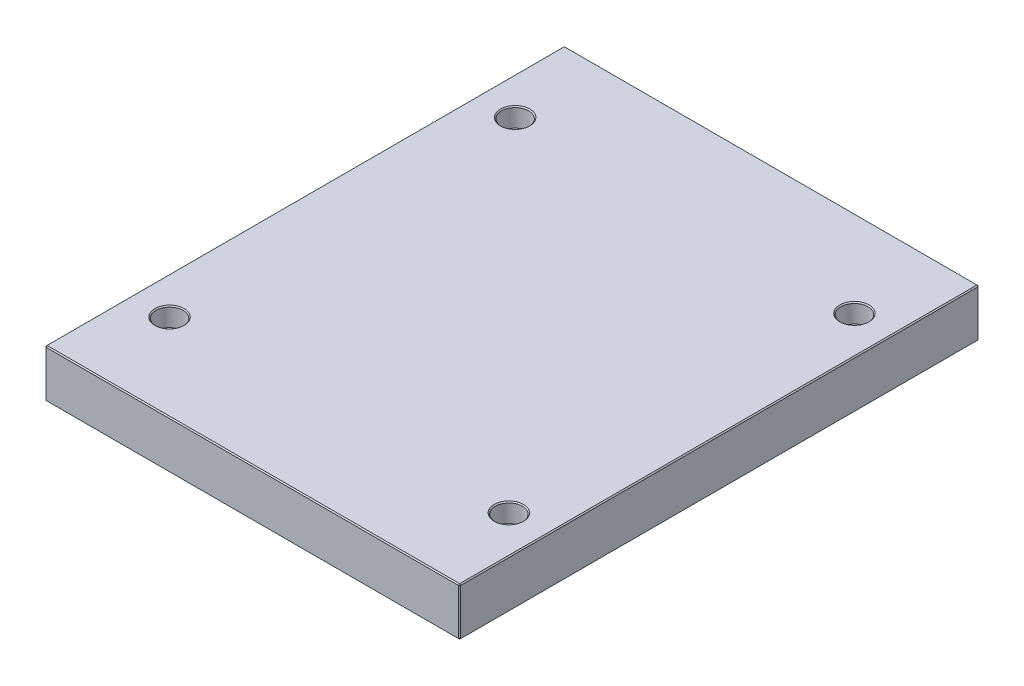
ISO-10303-21;
HEADER;
FILE_DESCRIPTION(('STEP AP214'),'2;1');
FILE_NAME('part.step','',(''),(''),'','','');
FILE_SCHEMA(('AUTOMOTIVE_DESIGN { 1 0 10303 214 1 1 1 1 }'));
ENDSEC;
DATA;
#1=APPLICATION_CONTEXT('core data for automotive mechanical design processes');
#2=APPLICATION_PROTOCOL_DEFINITION('international standard','automotive_design',2000,#1);
#3=PRODUCT_CONTEXT('',#1,'mechanical');
#4=PRODUCT('Part','Part','',(#3));
#5=PRODUCT_RELATED_PRODUCT_CATEGORY('part','',(#4));
#6=PRODUCT_DEFINITION_FORMATION('','',#4);
#7=PRODUCT_DEFINITION_CONTEXT('part definition',#1,'design');
#8=PRODUCT_DEFINITION('design','',#6,#7);
#9=PRODUCT_DEFINITION_SHAPE('','',#8);
#10=(LENGTH_UNIT() NAMED_UNIT(*) SI_UNIT(.MILLI.,.METRE.));
#11=(NAMED_UNIT(*) PLANE_ANGLE_UNIT() SI_UNIT($,.RADIAN.));
#12=(NAMED_UNIT(*) SI_UNIT($,.STERADIAN.) SOLID_ANGLE_UNIT());
#13=UNCERTAINTY_MEASURE_WITH_UNIT(LENGTH_MEASURE(1.E-05),#10,'distance_accuracy_value','');
#14=(GEOMETRIC_REPRESENTATION_CONTEXT(3) GLOBAL_UNCERTAINTY_ASSIGNED_CONTEXT((#13)) GLOBAL_UNIT_ASSIGNED_CONTEXT((#10,
#11,#12)) REPRESENTATION_CONTEXT('',''));
#15=CARTESIAN_POINT('',(0.,0.,0.));
#16=DIRECTION('',(0.,0.,1.));
#17=DIRECTION('',(1.,0.,0.));
#18=AXIS2_PLACEMENT_3D('',#15,#16,#17);
#19=CARTESIAN_POINT('',(-198.,46.,248.));
#20=DIRECTION('',(1.,0.,0.));
#21=DIRECTION('',(0.,0.,-1.));
#22=AXIS2_PLACEMENT_3D('',#19,#20,#21);
#23=PLANE('',#22);
#24=DIRECTION('',(0.,-1.,0.));
#25=VECTOR('',#24,1.);
#26=CARTESIAN_POINT('',(-198.,46.,-247.));
#27=LINE('',#26,#25);
#28=CARTESIAN_POINT('',(-198.,45.,-247.));
#29=VERTEX_POINT('',#28);
#30=CARTESIAN_POINT('',(-198.,1.,-247.));
#31=VERTEX_POINT('',#30);
#32=EDGE_CURVE('E115',#29,#31,#27,.T.);
#33=ORIENTED_EDGE('',*,*,#32,.T.);
#34=DIRECTION('',(0.,0.,1.));
#35=VECTOR('',#34,1.);
#36=CARTESIAN_POINT('',(-198.,1.,248.));
#37=LINE('',#36,#35);
#38=CARTESIAN_POINT('',(-198.,1.,247.));
#39=VERTEX_POINT('',#38);
#40=EDGE_CURVE('E111',#31,#39,#37,.T.);
#41=ORIENTED_EDGE('',*,*,#40,.T.);
#42=DIRECTION('',(0.,1.,0.));
#43=VECTOR('',#42,1.);
#44=CARTESIAN_POINT('',(-198.,46.,247.));
#45=LINE('',#44,#43);
#46=CARTESIAN_POINT('',(-198.,45.,247.));
#47=VERTEX_POINT('',#46);
#48=EDGE_CURVE('E104',#39,#47,#45,.T.);
#49=ORIENTED_EDGE('',*,*,#48,.T.);
#50=DIRECTION('',(0.,0.,-1.));
#51=VECTOR('',#50,1.);
#52=CARTESIAN_POINT('',(-198.,45.,-248.));
#53=LINE('',#52,#51);
#54=EDGE_CURVE('E108',#47,#29,#53,.T.);
#55=ORIENTED_EDGE('',*,*,#54,.T.);
#56=EDGE_LOOP('',(#33,#41,#49,#55));
#57=FACE_BOUND('',#56,.T.);
#58=ADVANCED_FACE('F16',(#57),#23,.F.);
#59=CARTESIAN_POINT('',(198.,46.,248.));
#60=DIRECTION('',(0.,0.,-1.));
#61=DIRECTION('',(-1.,0.,0.));
#62=AXIS2_PLACEMENT_3D('',#59,#60,#61);
#63=PLANE('',#62);
#64=DIRECTION('',(-1.,0.,0.));
#65=VECTOR('',#64,1.);
#66=CARTESIAN_POINT('',(-198.,45.,248.));
#67=LINE('',#66,#65);
#68=CARTESIAN_POINT('',(197.,45.,248.));
#69=VERTEX_POINT('',#68);
#70=CARTESIAN_POINT('',(-197.,45.,248.));
#71=VERTEX_POINT('',#70);
#72=EDGE_CURVE('E170',#69,#71,#67,.T.);
#73=ORIENTED_EDGE('',*,*,#72,.T.);
#74=DIRECTION('',(0.,-1.,0.));
#75=VECTOR('',#74,1.);
#76=CARTESIAN_POINT('',(-197.,46.,248.));
#77=LINE('',#76,#75);
#78=CARTESIAN_POINT('',(-197.,1.,248.));
#79=VERTEX_POINT('',#78);
#80=EDGE_CURVE('E123',#71,#79,#77,.T.);
#81=ORIENTED_EDGE('',*,*,#80,.T.);
#82=DIRECTION('',(1.,0.,0.));
#83=VECTOR('',#82,1.);
#84=CARTESIAN_POINT('',(198.,1.,248.));
#85=LINE('',#84,#83);
#86=CARTESIAN_POINT('',(197.,1.,248.));
#87=VERTEX_POINT('',#86);
#88=EDGE_CURVE('E174',#79,#87,#85,.T.);
#89=ORIENTED_EDGE('',*,*,#88,.T.);
#90=DIRECTION('',(0.,1.,0.));
#91=VECTOR('',#90,1.);
#92=CARTESIAN_POINT('',(197.,46.,248.));
#93=LINE('',#92,#91);
#94=EDGE_CURVE('E172',#87,#69,#93,.T.);
#95=ORIENTED_EDGE('',*,*,#94,.T.);
#96=EDGE_LOOP('',(#73,#81,#89,#95));
#97=FACE_BOUND('',#96,.T.);
#98=ADVANCED_FACE('F317',(#97),#63,.F.);
#99=CARTESIAN_POINT('',(198.,46.,248.));
#100=DIRECTION('',(-1.,0.,0.));
#101=DIRECTION('',(0.,0.,1.));
#102=AXIS2_PLACEMENT_3D('',#99,#100,#101);
#103=PLANE('',#102);
#104=DIRECTION('',(0.,0.,-1.));
#105=VECTOR('',#104,1.);
#106=CARTESIAN_POINT('',(198.,1.,248.));
#107=LINE('',#106,#105);
#108=CARTESIAN_POINT('',(198.,1.,247.));
#109=VERTEX_POINT('',#108);
#110=CARTESIAN_POINT('',(198.,1.,-247.));
#111=VERTEX_POINT('',#110);
#112=EDGE_CURVE('E165',#109,#111,#107,.T.);
#113=ORIENTED_EDGE('',*,*,#112,.T.);
#114=DIRECTION('',(0.,1.,0.));
#115=VECTOR('',#114,1.);
#116=CARTESIAN_POINT('',(198.,46.,-247.));
#117=LINE('',#116,#115);
#118=CARTESIAN_POINT('',(198.,45.,-247.));
#119=VERTEX_POINT('',#118);
#120=EDGE_CURVE('E167',#111,#119,#117,.T.);
#121=ORIENTED_EDGE('',*,*,#120,.T.);
#122=DIRECTION('',(0.,0.,1.));
#123=VECTOR('',#122,1.);
#124=CARTESIAN_POINT('',(198.,45.,248.));
#125=LINE('',#124,#123);
#126=CARTESIAN_POINT('',(198.,45.,247.));
#127=VERTEX_POINT('',#126);
#128=EDGE_CURVE('E161',#119,#127,#125,.T.);
#129=ORIENTED_EDGE('',*,*,#128,.T.);
#130=DIRECTION('',(0.,-1.,0.));
#131=VECTOR('',#130,1.);
#132=CARTESIAN_POINT('',(198.,46.,247.));
#133=LINE('',#132,#131);
#134=EDGE_CURVE('E163',#127,#109,#133,.T.);
#135=ORIENTED_EDGE('',*,*,#134,.T.);
#136=EDGE_LOOP('',(#113,#121,#129,#135));
#137=FACE_BOUND('',#136,.T.);
#138=ADVANCED_FACE('F323',(#137),#103,.F.);
#139=CARTESIAN_POINT('',(198.,46.,-248.));
#140=DIRECTION('',(0.,0.,1.));
#141=DIRECTION('',(1.,0.,0.));
#142=AXIS2_PLACEMENT_3D('',#139,#140,#141);
#143=PLANE('',#142);
#144=DIRECTION('',(0.,-1.,0.));
#145=VECTOR('',#144,1.);
#146=CARTESIAN_POINT('',(197.,46.,-248.));
#147=LINE('',#146,#145);
#148=CARTESIAN_POINT('',(197.,45.,-248.));
#149=VERTEX_POINT('',#148);
#150=CARTESIAN_POINT('',(197.,1.,-248.));
#151=VERTEX_POINT('',#150);
#152=EDGE_CURVE('E154',#149,#151,#147,.T.);
#153=ORIENTED_EDGE('',*,*,#152,.T.);
#154=DIRECTION('',(-1.,0.,0.));
#155=VECTOR('',#154,1.);
#156=CARTESIAN_POINT('',(198.,1.,-248.));
#157=LINE('',#156,#155);
#158=CARTESIAN_POINT('',(-197.,1.,-248.));
#159=VERTEX_POINT('',#158);
#160=EDGE_CURVE('E159',#151,#159,#157,.T.);
#161=ORIENTED_EDGE('',*,*,#160,.T.);
#162=DIRECTION('',(0.,1.,0.));
#163=VECTOR('',#162,1.);
#164=CARTESIAN_POINT('',(-197.,46.,-248.));
#165=LINE('',#164,#163);
#166=CARTESIAN_POINT('',(-197.,45.,-248.));
#167=VERTEX_POINT('',#166);
#168=EDGE_CURVE('E156',#159,#167,#165,.T.);
#169=ORIENTED_EDGE('',*,*,#168,.T.);
#170=DIRECTION('',(1.,0.,0.));
#171=VECTOR('',#170,1.);
#172=CARTESIAN_POINT('',(198.,45.,-248.));
#173=LINE('',#172,#171);
#174=EDGE_CURVE('E152',#167,#149,#173,.T.);
#175=ORIENTED_EDGE('',*,*,#174,.T.);
#176=EDGE_LOOP('',(#153,#161,#169,#175));
#177=FACE_BOUND('',#176,.T.);
#178=ADVANCED_FACE('F465',(#177),#143,.F.);
#179=CARTESIAN_POINT('',(0.,46.,0.));
#180=DIRECTION('',(0.,1.,0.));
#181=DIRECTION('',(0.,0.,1.));
#182=AXIS2_PLACEMENT_3D('',#179,#180,#181);
#183=PLANE('',#182);
#184=CARTESIAN_POINT('',(-162.,46.,165.));
#185=DIRECTION('',(0.,1.,0.));
#186=DIRECTION('',(0.,0.,1.));
#187=AXIS2_PLACEMENT_3D('',#184,#185,#186);
#188=CIRCLE('',#187,14.0000000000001);
#189=CARTESIAN_POINT('',(-162.,46.,179.));
#190=VERTEX_POINT('',#189);
#191=EDGE_CURVE('E290',#190,#190,#188,.F.);
#192=ORIENTED_EDGE('',*,*,#191,.T.);
#193=EDGE_LOOP('',(#192));
#194=FACE_BOUND('',#193,.T.);
#195=CARTESIAN_POINT('',(162.,46.,165.));
#196=DIRECTION('',(0.,1.,0.));
#197=DIRECTION('',(0.,0.,1.));
#198=AXIS2_PLACEMENT_3D('',#195,#196,#197);
#199=CIRCLE('',#198,14.0000000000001);
#200=CARTESIAN_POINT('',(162.,46.,179.));
#201=VERTEX_POINT('',#200);
#202=EDGE_CURVE('E287',#201,#201,#199,.F.);
#203=ORIENTED_EDGE('',*,*,#202,.T.);
#204=EDGE_LOOP('',(#203));
#205=FACE_BOUND('',#204,.T.);
#206=CARTESIAN_POINT('',(162.,46.,-165.));
#207=DIRECTION('',(0.,1.,0.));
#208=DIRECTION('',(0.,0.,1.));
#209=AXIS2_PLACEMENT_3D('',#206,#207,#208);
#210=CIRCLE('',#209,14.0000000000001);
#211=CARTESIAN_POINT('',(162.,46.,-151.));
#212=VERTEX_POINT('',#211);
#213=EDGE_CURVE('E284',#212,#212,#210,.F.);
#214=ORIENTED_EDGE('',*,*,#213,.T.);
#215=EDGE_LOOP('',(#214));
#216=FACE_BOUND('',#215,.T.);
#217=CARTESIAN_POINT('',(-162.,46.,-165.));
#218=DIRECTION('',(0.,1.,0.));
#219=DIRECTION('',(0.,0.,1.));
#220=AXIS2_PLACEMENT_3D('',#217,#218,#219);
#221=CIRCLE('',#220,14.0000000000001);
#222=CARTESIAN_POINT('',(-162.,46.,-151.));
#223=VERTEX_POINT('',#222);
#224=EDGE_CURVE('E281',#223,#223,#221,.F.);
#225=ORIENTED_EDGE('',*,*,#224,.T.);
#226=EDGE_LOOP('',(#225));
#227=FACE_BOUND('',#226,.T.);
#228=DIRECTION('',(0.,0.,-1.));
#229=VECTOR('',#228,1.);
#230=CARTESIAN_POINT('',(197.,46.,-248.));
#231=LINE('',#230,#229);
#232=CARTESIAN_POINT('',(197.,46.,247.));
#233=VERTEX_POINT('',#232);
#234=CARTESIAN_POINT('',(197.,46.,-247.));
#235=VERTEX_POINT('',#234);
#236=EDGE_CURVE('E31',#233,#235,#231,.T.);
#237=ORIENTED_EDGE('',*,*,#236,.T.);
#238=DIRECTION('',(-1.,0.,0.));
#239=VECTOR('',#238,1.);
#240=CARTESIAN_POINT('',(-198.,46.,-247.));
#241=LINE('',#240,#239);
#242=CARTESIAN_POINT('',(-197.,46.,-247.));
#243=VERTEX_POINT('',#242);
#244=EDGE_CURVE('E190',#235,#243,#241,.T.);
#245=ORIENTED_EDGE('',*,*,#244,.T.);
#246=DIRECTION('',(0.,0.,1.));
#247=VECTOR('',#246,1.);
#248=CARTESIAN_POINT('',(-197.,46.,248.));
#249=LINE('',#248,#247);
#250=CARTESIAN_POINT('',(-197.,46.,247.));
#251=VERTEX_POINT('',#250);
#252=EDGE_CURVE('E186',#243,#251,#249,.T.);
#253=ORIENTED_EDGE('',*,*,#252,.T.);
#254=DIRECTION('',(1.,0.,0.));
#255=VECTOR('',#254,1.);
#256=CARTESIAN_POINT('',(198.,46.,247.));
#257=LINE('',#256,#255);
#258=EDGE_CURVE('E36',#251,#233,#257,.T.);
#259=ORIENTED_EDGE('',*,*,#258,.T.);
#260=EDGE_LOOP('',(#237,#245,#253,#259));
#261=FACE_BOUND('',#260,.T.);
#262=ADVANCED_FACE('F462',(#194,#205,#216,#227,#261),#183,.T.);
#263=CARTESIAN_POINT('',(0.,0.,0.));
#264=DIRECTION('',(0.,1.,0.));
#265=DIRECTION('',(0.,0.,1.));
#266=AXIS2_PLACEMENT_3D('',#263,#264,#265);
#267=PLANE('',#266);
#268=CARTESIAN_POINT('',(162.,0.,-165.));
#269=DIRECTION('',(0.,1.,0.));
#270=DIRECTION('',(0.,0.,1.));
#271=AXIS2_PLACEMENT_3D('',#268,#269,#270);
#272=CIRCLE('',#271,10.);
#273=CARTESIAN_POINT('',(162.,0.,-155.));
#274=VERTEX_POINT('',#273);
#275=EDGE_CURVE('E263',#274,#274,#272,.T.);
#276=ORIENTED_EDGE('',*,*,#275,.T.);
#277=EDGE_LOOP('',(#276));
#278=FACE_BOUND('',#277,.T.);
#279=CARTESIAN_POINT('',(162.,0.,165.));
#280=DIRECTION('',(0.,1.,0.));
#281=DIRECTION('',(0.,0.,1.));
#282=AXIS2_PLACEMENT_3D('',#279,#280,#281);
#283=CIRCLE('',#282,10.);
#284=CARTESIAN_POINT('',(162.,0.,175.));
#285=VERTEX_POINT('',#284);
#286=EDGE_CURVE('E260',#285,#285,#283,.T.);
#287=ORIENTED_EDGE('',*,*,#286,.T.);
#288=EDGE_LOOP('',(#287));
#289=FACE_BOUND('',#288,.T.);
#290=CARTESIAN_POINT('',(-162.,0.,165.));
#291=DIRECTION('',(0.,1.,0.));
#292=DIRECTION('',(0.,0.,1.));
#293=AXIS2_PLACEMENT_3D('',#290,#291,#292);
#294=CIRCLE('',#293,10.);
#295=CARTESIAN_POINT('',(-162.,0.,175.));
#296=VERTEX_POINT('',#295);
#297=EDGE_CURVE('E257',#296,#296,#294,.T.);
#298=ORIENTED_EDGE('',*,*,#297,.T.);
#299=EDGE_LOOP('',(#298));
#300=FACE_BOUND('',#299,.T.);
#301=CARTESIAN_POINT('',(-162.,0.,-165.));
#302=DIRECTION('',(0.,1.,0.));
#303=DIRECTION('',(0.,0.,1.));
#304=AXIS2_PLACEMENT_3D('',#301,#302,#303);
#305=CIRCLE('',#304,10.);
#306=CARTESIAN_POINT('',(-162.,0.,-155.));
#307=VERTEX_POINT('',#306);
#308=EDGE_CURVE('E192',#307,#307,#305,.T.);
#309=ORIENTED_EDGE('',*,*,#308,.T.);
#310=EDGE_LOOP('',(#309));
#311=FACE_BOUND('',#310,.T.);
#312=DIRECTION('',(0.,0.,1.));
#313=VECTOR('',#312,1.);
#314=CARTESIAN_POINT('',(197.,0.,0.));
#315=LINE('',#314,#313);
#316=CARTESIAN_POINT('',(197.,0.,-247.));
#317=VERTEX_POINT('',#316);
#318=CARTESIAN_POINT('',(197.,0.,247.));
#319=VERTEX_POINT('',#318);
#320=EDGE_CURVE('E177',#317,#319,#315,.T.);
#321=ORIENTED_EDGE('',*,*,#320,.T.);
#322=DIRECTION('',(-1.,0.,0.));
#323=VECTOR('',#322,1.);
#324=CARTESIAN_POINT('',(0.,0.,247.));
#325=LINE('',#324,#323);
#326=CARTESIAN_POINT('',(-197.,0.,247.));
#327=VERTEX_POINT('',#326);
#328=EDGE_CURVE('E183',#319,#327,#325,.T.);
#329=ORIENTED_EDGE('',*,*,#328,.T.);
#330=DIRECTION('',(0.,0.,-1.));
#331=VECTOR('',#330,1.);
#332=CARTESIAN_POINT('',(-197.,0.,0.));
#333=LINE('',#332,#331);
#334=CARTESIAN_POINT('',(-197.,0.,-247.));
#335=VERTEX_POINT('',#334);
#336=EDGE_CURVE('E181',#327,#335,#333,.T.);
#337=ORIENTED_EDGE('',*,*,#336,.T.);
#338=DIRECTION('',(1.,0.,0.));
#339=VECTOR('',#338,1.);
#340=CARTESIAN_POINT('',(0.,0.,-247.));
#341=LINE('',#340,#339);
#342=EDGE_CURVE('E179',#335,#317,#341,.T.);
#343=ORIENTED_EDGE('',*,*,#342,.T.);
#344=EDGE_LOOP('',(#321,#329,#337,#343));
#345=FACE_BOUND('',#344,.T.);
#346=ADVANCED_FACE('F402',(#278,#289,#300,#311,#345),#267,.F.);
#347=CARTESIAN_POINT('',(198.,46.,247.));
#348=DIRECTION('',(-0.707106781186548,0.,-0.707106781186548));
#349=DIRECTION('',(0.,-1.,0.));
#350=AXIS2_PLACEMENT_3D('',#347,#348,#349);
#351=PLANE('',#350);
#352=DIRECTION('',(-0.707106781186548,0.,0.707106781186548));
#353=VECTOR('',#352,1.);
#354=CARTESIAN_POINT('',(197.,45.,248.));
#355=LINE('',#354,#353);
#356=EDGE_CURVE('E141',#69,#127,#355,.F.);
#357=ORIENTED_EDGE('',*,*,#356,.F.);
#358=ORIENTED_EDGE('',*,*,#94,.F.);
#359=DIRECTION('',(0.707106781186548,0.,-0.707106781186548));
#360=VECTOR('',#359,1.);
#361=CARTESIAN_POINT('',(197.,1.,248.));
#362=LINE('',#361,#360);
#363=EDGE_CURVE('E144',#109,#87,#362,.F.);
#364=ORIENTED_EDGE('',*,*,#363,.F.);
#365=ORIENTED_EDGE('',*,*,#134,.F.);
#366=EDGE_LOOP('',(#357,#358,#364,#365));
#367=FACE_BOUND('',#366,.T.);
#368=ADVANCED_FACE('F398',(#367),#351,.F.);
#369=CARTESIAN_POINT('',(197.,45.,248.));
#370=DIRECTION('',(0.577350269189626,0.577350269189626,0.577350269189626));
#371=DIRECTION('',(0.707106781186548,0.,-0.707106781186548));
#372=AXIS2_PLACEMENT_3D('',#369,#370,#371);
#373=PLANE('',#372);
#374=DIRECTION('',(0.,-0.707106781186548,0.707106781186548));
#375=VECTOR('',#374,1.);
#376=CARTESIAN_POINT('',(197.,45.,248.));
#377=LINE('',#376,#375);
#378=EDGE_CURVE('E235',#69,#233,#377,.F.);
#379=ORIENTED_EDGE('',*,*,#378,.F.);
#380=ORIENTED_EDGE('',*,*,#356,.T.);
#381=DIRECTION('',(-0.707106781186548,0.707106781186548,0.));
#382=VECTOR('',#381,1.);
#383=CARTESIAN_POINT('',(197.5,45.5,247.));
#384=LINE('',#383,#382);
#385=EDGE_CURVE('E237',#233,#127,#384,.F.);
#386=ORIENTED_EDGE('',*,*,#385,.F.);
#387=EDGE_LOOP('',(#379,#380,#386));
#388=FACE_BOUND('',#387,.T.);
#389=ADVANCED_FACE('F394',(#388),#373,.T.);
#390=CARTESIAN_POINT('',(197.,1.,248.));
#391=DIRECTION('',(0.577350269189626,-0.577350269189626,0.577350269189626));
#392=DIRECTION('',(0.707106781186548,0.,-0.707106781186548));
#393=AXIS2_PLACEMENT_3D('',#390,#391,#392);
#394=PLANE('',#393);
#395=DIRECTION('',(-0.707106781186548,-0.707106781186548,0.));
#396=VECTOR('',#395,1.);
#397=CARTESIAN_POINT('',(197.5,0.5,247.));
#398=LINE('',#397,#396);
#399=EDGE_CURVE('E229',#109,#319,#398,.T.);
#400=ORIENTED_EDGE('',*,*,#399,.F.);
#401=ORIENTED_EDGE('',*,*,#363,.T.);
#402=DIRECTION('',(0.,0.707106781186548,0.707106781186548));
#403=VECTOR('',#402,1.);
#404=CARTESIAN_POINT('',(197.,1.,248.));
#405=LINE('',#404,#403);
#406=EDGE_CURVE('E232',#319,#87,#405,.T.);
#407=ORIENTED_EDGE('',*,*,#406,.F.);
#408=EDGE_LOOP('',(#400,#401,#407));
#409=FACE_BOUND('',#408,.T.);
#410=ADVANCED_FACE('F390',(#409),#394,.T.);
#411=CARTESIAN_POINT('',(197.,46.,0.));
#412=DIRECTION('',(0.707106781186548,0.707106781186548,0.));
#413=DIRECTION('',(0.,0.,1.));
#414=AXIS2_PLACEMENT_3D('',#411,#412,#413);
#415=PLANE('',#414);
#416=ORIENTED_EDGE('',*,*,#385,.T.);
#417=ORIENTED_EDGE('',*,*,#128,.F.);
#418=DIRECTION('',(0.707106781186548,-0.707106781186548,0.));
#419=VECTOR('',#418,1.);
#420=CARTESIAN_POINT('',(198.,45.,-247.));
#421=LINE('',#420,#419);
#422=EDGE_CURVE('E224',#235,#119,#421,.T.);
#423=ORIENTED_EDGE('',*,*,#422,.F.);
#424=ORIENTED_EDGE('',*,*,#236,.F.);
#425=EDGE_LOOP('',(#416,#417,#423,#424));
#426=FACE_BOUND('',#425,.T.);
#427=ADVANCED_FACE('F386',(#426),#415,.T.);
#428=CARTESIAN_POINT('',(0.,46.,247.));
#429=DIRECTION('',(0.,0.707106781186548,0.707106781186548));
#430=DIRECTION('',(-1.,0.,0.));
#431=AXIS2_PLACEMENT_3D('',#428,#429,#430);
#432=PLANE('',#431);
#433=ORIENTED_EDGE('',*,*,#378,.T.);
#434=ORIENTED_EDGE('',*,*,#258,.F.);
#435=DIRECTION('',(0.,0.707106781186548,-0.707106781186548));
#436=VECTOR('',#435,1.);
#437=CARTESIAN_POINT('',(-197.,45.5,247.5));
#438=LINE('',#437,#436);
#439=EDGE_CURVE('E127',#71,#251,#438,.T.);
#440=ORIENTED_EDGE('',*,*,#439,.F.);
#441=ORIENTED_EDGE('',*,*,#72,.F.);
#442=EDGE_LOOP('',(#433,#434,#440,#441));
#443=FACE_BOUND('',#442,.T.);
#444=ADVANCED_FACE('F383',(#443),#432,.T.);
#445=CARTESIAN_POINT('',(-197.,46.,248.));
#446=DIRECTION('',(0.707106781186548,0.,-0.707106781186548));
#447=DIRECTION('',(0.,-1.,0.));
#448=AXIS2_PLACEMENT_3D('',#445,#446,#447);
#449=PLANE('',#448);
#450=DIRECTION('',(0.707106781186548,0.,0.707106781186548));
#451=VECTOR('',#450,1.);
#452=CARTESIAN_POINT('',(-197.,1.,248.));
#453=LINE('',#452,#451);
#454=EDGE_CURVE('E128',#79,#39,#453,.F.);
#455=ORIENTED_EDGE('',*,*,#454,.F.);
#456=ORIENTED_EDGE('',*,*,#80,.F.);
#457=DIRECTION('',(-0.707106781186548,0.,-0.707106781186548));
#458=VECTOR('',#457,1.);
#459=CARTESIAN_POINT('',(-198.,45.,247.));
#460=LINE('',#459,#458);
#461=EDGE_CURVE('E119',#47,#71,#460,.F.);
#462=ORIENTED_EDGE('',*,*,#461,.F.);
#463=ORIENTED_EDGE('',*,*,#48,.F.);
#464=EDGE_LOOP('',(#455,#456,#462,#463));
#465=FACE_BOUND('',#464,.T.);
#466=ADVANCED_FACE('F121',(#465),#449,.F.);
#467=CARTESIAN_POINT('',(198.,1.,248.));
#468=DIRECTION('',(0.,0.707106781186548,-0.707106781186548));
#469=DIRECTION('',(1.,0.,0.));
#470=AXIS2_PLACEMENT_3D('',#467,#468,#469);
#471=PLANE('',#470);
#472=ORIENTED_EDGE('',*,*,#406,.T.);
#473=ORIENTED_EDGE('',*,*,#88,.F.);
#474=DIRECTION('',(0.,-0.707106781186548,-0.707106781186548));
#475=VECTOR('',#474,1.);
#476=CARTESIAN_POINT('',(-197.,1.,248.));
#477=LINE('',#476,#475);
#478=EDGE_CURVE('E220',#327,#79,#477,.F.);
#479=ORIENTED_EDGE('',*,*,#478,.F.);
#480=ORIENTED_EDGE('',*,*,#328,.F.);
#481=EDGE_LOOP('',(#472,#473,#479,#480));
#482=FACE_BOUND('',#481,.T.);
#483=ADVANCED_FACE('F376',(#482),#471,.F.);
#484=CARTESIAN_POINT('',(198.,1.,248.));
#485=DIRECTION('',(-0.707106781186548,0.707106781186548,0.));
#486=DIRECTION('',(0.,0.,-1.));
#487=AXIS2_PLACEMENT_3D('',#484,#485,#486);
#488=PLANE('',#487);
#489=ORIENTED_EDGE('',*,*,#399,.T.);
#490=ORIENTED_EDGE('',*,*,#320,.F.);
#491=DIRECTION('',(0.707106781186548,0.707106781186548,0.));
#492=VECTOR('',#491,1.);
#493=CARTESIAN_POINT('',(197.5,0.500000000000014,-247.));
#494=LINE('',#493,#492);
#495=EDGE_CURVE('E217',#111,#317,#494,.F.);
#496=ORIENTED_EDGE('',*,*,#495,.F.);
#497=ORIENTED_EDGE('',*,*,#112,.F.);
#498=EDGE_LOOP('',(#489,#490,#496,#497));
#499=FACE_BOUND('',#498,.T.);
#500=ADVANCED_FACE('F372',(#499),#488,.F.);
#501=CARTESIAN_POINT('',(197.,46.,-248.));
#502=DIRECTION('',(-0.707106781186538,0.,0.707106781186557));
#503=DIRECTION('',(0.,-1.,0.));
#504=AXIS2_PLACEMENT_3D('',#501,#502,#503);
#505=PLANE('',#504);
#506=DIRECTION('',(0.707106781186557,0.,0.707106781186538));
#507=VECTOR('',#506,1.);
#508=CARTESIAN_POINT('',(198.,45.,-247.));
#509=LINE('',#508,#507);
#510=EDGE_CURVE('E226',#119,#149,#509,.F.);
#511=ORIENTED_EDGE('',*,*,#510,.F.);
#512=ORIENTED_EDGE('',*,*,#120,.F.);
#513=DIRECTION('',(-0.707106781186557,0.,-0.707106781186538));
#514=VECTOR('',#513,1.);
#515=CARTESIAN_POINT('',(197.,1.,-248.));
#516=LINE('',#515,#514);
#517=EDGE_CURVE('E214',#151,#111,#516,.F.);
#518=ORIENTED_EDGE('',*,*,#517,.F.);
#519=ORIENTED_EDGE('',*,*,#152,.F.);
#520=EDGE_LOOP('',(#511,#512,#518,#519));
#521=FACE_BOUND('',#520,.T.);
#522=ADVANCED_FACE('F368',(#521),#505,.F.);
#523=CARTESIAN_POINT('',(198.,45.,-247.));
#524=DIRECTION('',(0.577350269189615,0.577350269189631,-0.577350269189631));
#525=DIRECTION('',(0.,0.707106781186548,0.707106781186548));
#526=AXIS2_PLACEMENT_3D('',#523,#524,#525);
#527=PLANE('',#526);
#528=ORIENTED_EDGE('',*,*,#422,.T.);
#529=ORIENTED_EDGE('',*,*,#510,.T.);
#530=DIRECTION('',(0.,0.707106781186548,0.707106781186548));
#531=VECTOR('',#530,1.);
#532=CARTESIAN_POINT('',(197.,45.5,-247.5));
#533=LINE('',#532,#531);
#534=EDGE_CURVE('E135',#235,#149,#533,.F.);
#535=ORIENTED_EDGE('',*,*,#534,.F.);
#536=EDGE_LOOP('',(#528,#529,#535));
#537=FACE_BOUND('',#536,.T.);
#538=ADVANCED_FACE('F365',(#537),#527,.T.);
#539=CARTESIAN_POINT('',(-198.,45.,247.));
#540=DIRECTION('',(-0.577350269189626,0.577350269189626,0.577350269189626));
#541=DIRECTION('',(0.707106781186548,0.,0.707106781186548));
#542=AXIS2_PLACEMENT_3D('',#539,#540,#541);
#543=PLANE('',#542);
#544=ORIENTED_EDGE('',*,*,#461,.T.);
#545=ORIENTED_EDGE('',*,*,#439,.T.);
#546=DIRECTION('',(-0.707106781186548,-0.707106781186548,0.));
#547=VECTOR('',#546,1.);
#548=CARTESIAN_POINT('',(-198.,45.,247.));
#549=LINE('',#548,#547);
#550=EDGE_CURVE('E131',#47,#251,#549,.F.);
#551=ORIENTED_EDGE('',*,*,#550,.F.);
#552=EDGE_LOOP('',(#544,#545,#551));
#553=FACE_BOUND('',#552,.T.);
#554=ADVANCED_FACE('F132',(#553),#543,.T.);
#555=CARTESIAN_POINT('',(-197.,1.,248.));
#556=DIRECTION('',(-0.577350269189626,-0.577350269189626,0.577350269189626));
#557=DIRECTION('',(0.707106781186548,0.,0.707106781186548));
#558=AXIS2_PLACEMENT_3D('',#555,#556,#557);
#559=PLANE('',#558);
#560=ORIENTED_EDGE('',*,*,#478,.T.);
#561=ORIENTED_EDGE('',*,*,#454,.T.);
#562=DIRECTION('',(-0.707106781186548,0.707106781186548,0.));
#563=VECTOR('',#562,1.);
#564=CARTESIAN_POINT('',(-197.5,0.5,247.));
#565=LINE('',#564,#563);
#566=EDGE_CURVE('E136',#327,#39,#565,.T.);
#567=ORIENTED_EDGE('',*,*,#566,.F.);
#568=EDGE_LOOP('',(#560,#561,#567));
#569=FACE_BOUND('',#568,.T.);
#570=ADVANCED_FACE('F358',(#569),#559,.T.);
#571=CARTESIAN_POINT('',(197.,1.,-248.));
#572=DIRECTION('',(0.577350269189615,-0.577350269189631,-0.577350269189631));
#573=DIRECTION('',(0.,0.707106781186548,-0.707106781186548));
#574=AXIS2_PLACEMENT_3D('',#571,#572,#573);
#575=PLANE('',#574);
#576=ORIENTED_EDGE('',*,*,#517,.T.);
#577=ORIENTED_EDGE('',*,*,#495,.T.);
#578=DIRECTION('',(0.,-0.707106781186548,0.707106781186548));
#579=VECTOR('',#578,1.);
#580=CARTESIAN_POINT('',(197.,1.,-248.));
#581=LINE('',#580,#579);
#582=EDGE_CURVE('E207',#151,#317,#581,.T.);
#583=ORIENTED_EDGE('',*,*,#582,.F.);
#584=EDGE_LOOP('',(#576,#577,#583));
#585=FACE_BOUND('',#584,.T.);
#586=ADVANCED_FACE('F354',(#585),#575,.T.);
#587=CARTESIAN_POINT('',(0.,46.,-247.));
#588=DIRECTION('',(0.,0.707106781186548,-0.707106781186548));
#589=DIRECTION('',(1.,0.,0.));
#590=AXIS2_PLACEMENT_3D('',#587,#588,#589);
#591=PLANE('',#590);
#592=ORIENTED_EDGE('',*,*,#534,.T.);
#593=ORIENTED_EDGE('',*,*,#174,.F.);
#594=DIRECTION('',(0.,-0.707106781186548,-0.707106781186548));
#595=VECTOR('',#594,1.);
#596=CARTESIAN_POINT('',(-197.,45.,-248.));
#597=LINE('',#596,#595);
#598=EDGE_CURVE('E204',#243,#167,#597,.T.);
#599=ORIENTED_EDGE('',*,*,#598,.F.);
#600=ORIENTED_EDGE('',*,*,#244,.F.);
#601=EDGE_LOOP('',(#592,#593,#599,#600));
#602=FACE_BOUND('',#601,.T.);
#603=ADVANCED_FACE('F351',(#602),#591,.T.);
#604=CARTESIAN_POINT('',(-197.,46.,0.));
#605=DIRECTION('',(-0.707106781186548,0.707106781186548,0.));
#606=DIRECTION('',(0.,0.,-1.));
#607=AXIS2_PLACEMENT_3D('',#604,#605,#606);
#608=PLANE('',#607);
#609=ORIENTED_EDGE('',*,*,#550,.T.);
#610=ORIENTED_EDGE('',*,*,#252,.F.);
#611=DIRECTION('',(0.707106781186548,0.707106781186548,0.));
#612=VECTOR('',#611,1.);
#613=CARTESIAN_POINT('',(-197.5,45.5,-247.));
#614=LINE('',#613,#612);
#615=EDGE_CURVE('E139',#29,#243,#614,.T.);
#616=ORIENTED_EDGE('',*,*,#615,.F.);
#617=ORIENTED_EDGE('',*,*,#54,.F.);
#618=EDGE_LOOP('',(#609,#610,#616,#617));
#619=FACE_BOUND('',#618,.T.);
#620=ADVANCED_FACE('F138',(#619),#608,.T.);
#621=CARTESIAN_POINT('',(-198.,1.,248.));
#622=DIRECTION('',(0.707106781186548,0.707106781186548,0.));
#623=DIRECTION('',(0.,0.,1.));
#624=AXIS2_PLACEMENT_3D('',#621,#622,#623);
#625=PLANE('',#624);
#626=ORIENTED_EDGE('',*,*,#566,.T.);
#627=ORIENTED_EDGE('',*,*,#40,.F.);
#628=DIRECTION('',(0.707106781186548,-0.707106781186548,0.));
#629=VECTOR('',#628,1.);
#630=CARTESIAN_POINT('',(-198.,1.,-247.));
#631=LINE('',#630,#629);
#632=EDGE_CURVE('E200',#335,#31,#631,.F.);
#633=ORIENTED_EDGE('',*,*,#632,.F.);
#634=ORIENTED_EDGE('',*,*,#336,.F.);
#635=EDGE_LOOP('',(#626,#627,#633,#634));
#636=FACE_BOUND('',#635,.T.);
#637=ADVANCED_FACE('F344',(#636),#625,.F.);
#638=CARTESIAN_POINT('',(198.,1.,-248.));
#639=DIRECTION('',(0.,0.707106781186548,0.707106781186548));
#640=DIRECTION('',(-1.,0.,0.));
#641=AXIS2_PLACEMENT_3D('',#638,#639,#640);
#642=PLANE('',#641);
#643=ORIENTED_EDGE('',*,*,#582,.T.);
#644=ORIENTED_EDGE('',*,*,#342,.F.);
#645=DIRECTION('',(0.,0.707106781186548,-0.707106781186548));
#646=VECTOR('',#645,1.);
#647=CARTESIAN_POINT('',(-197.,0.499999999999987,-247.5));
#648=LINE('',#647,#646);
#649=EDGE_CURVE('E197',#159,#335,#648,.F.);
#650=ORIENTED_EDGE('',*,*,#649,.F.);
#651=ORIENTED_EDGE('',*,*,#160,.F.);
#652=EDGE_LOOP('',(#643,#644,#650,#651));
#653=FACE_BOUND('',#652,.T.);
#654=ADVANCED_FACE('F340',(#653),#642,.F.);
#655=CARTESIAN_POINT('',(-197.,45.,-248.));
#656=DIRECTION('',(-0.577350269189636,0.57735026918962,-0.57735026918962));
#657=DIRECTION('',(-0.707106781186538,0.,0.707106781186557));
#658=AXIS2_PLACEMENT_3D('',#655,#656,#657);
#659=PLANE('',#658);
#660=ORIENTED_EDGE('',*,*,#615,.T.);
#661=ORIENTED_EDGE('',*,*,#598,.T.);
#662=DIRECTION('',(0.707106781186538,0.,-0.707106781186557));
#663=VECTOR('',#662,1.);
#664=CARTESIAN_POINT('',(-197.,45.,-248.));
#665=LINE('',#664,#663);
#666=EDGE_CURVE('E195',#29,#167,#665,.T.);
#667=ORIENTED_EDGE('',*,*,#666,.F.);
#668=EDGE_LOOP('',(#660,#661,#667));
#669=FACE_BOUND('',#668,.T.);
#670=ADVANCED_FACE('F336',(#669),#659,.T.);
#671=CARTESIAN_POINT('',(-198.,1.,-247.));
#672=DIRECTION('',(-0.577350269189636,-0.57735026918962,-0.57735026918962));
#673=DIRECTION('',(-0.707106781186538,0.,0.707106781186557));
#674=AXIS2_PLACEMENT_3D('',#671,#672,#673);
#675=PLANE('',#674);
#676=ORIENTED_EDGE('',*,*,#649,.T.);
#677=ORIENTED_EDGE('',*,*,#632,.T.);
#678=DIRECTION('',(-0.707106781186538,0.,0.707106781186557));
#679=VECTOR('',#678,1.);
#680=CARTESIAN_POINT('',(-198.,1.,-247.));
#681=LINE('',#680,#679);
#682=EDGE_CURVE('E193',#159,#31,#681,.T.);
#683=ORIENTED_EDGE('',*,*,#682,.F.);
#684=EDGE_LOOP('',(#676,#677,#683));
#685=FACE_BOUND('',#684,.T.);
#686=ADVANCED_FACE('F332',(#685),#675,.T.);
#687=CARTESIAN_POINT('',(-198.,46.,-247.));
#688=DIRECTION('',(0.707106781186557,0.,0.707106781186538));
#689=DIRECTION('',(0.,-1.,0.));
#690=AXIS2_PLACEMENT_3D('',#687,#688,#689);
#691=PLANE('',#690);
#692=ORIENTED_EDGE('',*,*,#666,.T.);
#693=ORIENTED_EDGE('',*,*,#168,.F.);
#694=ORIENTED_EDGE('',*,*,#682,.T.);
#695=ORIENTED_EDGE('',*,*,#32,.F.);
#696=EDGE_LOOP('',(#692,#693,#694,#695));
#697=FACE_BOUND('',#696,.T.);
#698=ADVANCED_FACE('F328',(#697),#691,.F.);
#699=CARTESIAN_POINT('',(-162.,28.,-165.));
#700=DIRECTION('',(0.,1.,0.));
#701=DIRECTION('',(0.,0.,1.));
#702=AXIS2_PLACEMENT_3D('',#699,#700,#701);
#703=CYLINDRICAL_SURFACE('',#702,13.);
#704=CARTESIAN_POINT('',(-162.,45.,-165.));
#705=DIRECTION('',(0.,1.,0.));
#706=DIRECTION('',(0.,0.,1.));
#707=AXIS2_PLACEMENT_3D('',#704,#705,#706);
#708=CIRCLE('',#707,13.);
#709=CARTESIAN_POINT('',(-162.,45.,-152.));
#710=VERTEX_POINT('',#709);
#711=EDGE_CURVE('E10',#710,#710,#708,.T.);
#712=ORIENTED_EDGE('',*,*,#711,.T.);
#713=EDGE_LOOP('',(#712));
#714=FACE_BOUND('',#713,.T.);
#715=CARTESIAN_POINT('',(-162.,28.,-165.));
#716=DIRECTION('',(0.,1.,0.));
#717=DIRECTION('',(0.,0.,1.));
#718=AXIS2_PLACEMENT_3D('',#715,#716,#717);
#719=CIRCLE('',#718,13.);
#720=CARTESIAN_POINT('',(-162.,28.,-152.));
#721=VERTEX_POINT('',#720);
#722=EDGE_CURVE('E147',#721,#721,#719,.T.);
#723=ORIENTED_EDGE('',*,*,#722,.F.);
#724=EDGE_LOOP('',(#723));
#725=FACE_BOUND('',#724,.T.);
#726=ADVANCED_FACE('F331',(#714,#725),#703,.F.);
#727=CARTESIAN_POINT('',(-162.,28.,-165.));
#728=DIRECTION('',(0.,1.,0.));
#729=DIRECTION('',(0.,0.,1.));
#730=AXIS2_PLACEMENT_3D('',#727,#728,#729);
#731=PLANE('',#730);
#732=CARTESIAN_POINT('',(-162.,28.,-165.));
#733=DIRECTION('',(0.,1.,0.));
#734=DIRECTION('',(0.,0.,1.));
#735=AXIS2_PLACEMENT_3D('',#732,#733,#734);
#736=CIRCLE('',#735,9.);
#737=CARTESIAN_POINT('',(-162.,28.,-156.));
#738=VERTEX_POINT('',#737);
#739=EDGE_CURVE('E251',#738,#738,#736,.T.);
#740=ORIENTED_EDGE('',*,*,#739,.F.);
#741=EDGE_LOOP('',(#740));
#742=FACE_BOUND('',#741,.T.);
#743=ORIENTED_EDGE('',*,*,#722,.T.);
#744=EDGE_LOOP('',(#743));
#745=FACE_BOUND('',#744,.T.);
#746=ADVANCED_FACE('F450',(#742,#745),#731,.T.);
#747=CARTESIAN_POINT('',(162.,28.,-165.));
#748=DIRECTION('',(0.,1.,0.));
#749=DIRECTION('',(0.,0.,1.));
#750=AXIS2_PLACEMENT_3D('',#747,#748,#749);
#751=CYLINDRICAL_SURFACE('',#750,13.);
#752=CARTESIAN_POINT('',(162.,45.,-165.));
#753=DIRECTION('',(0.,1.,0.));
#754=DIRECTION('',(0.,0.,1.));
#755=AXIS2_PLACEMENT_3D('',#752,#753,#754);
#756=CIRCLE('',#755,13.);
#757=CARTESIAN_POINT('',(162.,45.,-152.));
#758=VERTEX_POINT('',#757);
#759=EDGE_CURVE('E24',#758,#758,#756,.T.);
#760=ORIENTED_EDGE('',*,*,#759,.T.);
#761=EDGE_LOOP('',(#760));
#762=FACE_BOUND('',#761,.T.);
#763=CARTESIAN_POINT('',(162.,28.,-165.));
#764=DIRECTION('',(0.,1.,0.));
#765=DIRECTION('',(0.,0.,1.));
#766=AXIS2_PLACEMENT_3D('',#763,#764,#765);
#767=CIRCLE('',#766,13.);
#768=CARTESIAN_POINT('',(162.,28.,-152.));
#769=VERTEX_POINT('',#768);
#770=EDGE_CURVE('E441',#769,#769,#767,.T.);
#771=ORIENTED_EDGE('',*,*,#770,.F.);
#772=EDGE_LOOP('',(#771));
#773=FACE_BOUND('',#772,.T.);
#774=ADVANCED_FACE('F298',(#762,#773),#751,.F.);
#775=CARTESIAN_POINT('',(162.,28.,-165.));
#776=DIRECTION('',(0.,1.,0.));
#777=DIRECTION('',(0.,0.,1.));
#778=AXIS2_PLACEMENT_3D('',#775,#776,#777);
#779=PLANE('',#778);
#780=CARTESIAN_POINT('',(162.,28.,-165.));
#781=DIRECTION('',(0.,1.,0.));
#782=DIRECTION('',(0.,0.,1.));
#783=AXIS2_PLACEMENT_3D('',#780,#781,#782);
#784=CIRCLE('',#783,9.);
#785=CARTESIAN_POINT('',(162.,28.,-156.));
#786=VERTEX_POINT('',#785);
#787=EDGE_CURVE('E248',#786,#786,#784,.T.);
#788=ORIENTED_EDGE('',*,*,#787,.F.);
#789=EDGE_LOOP('',(#788));
#790=FACE_BOUND('',#789,.T.);
#791=ORIENTED_EDGE('',*,*,#770,.T.);
#792=EDGE_LOOP('',(#791));
#793=FACE_BOUND('',#792,.T.);
#794=ADVANCED_FACE('F738',(#790,#793),#779,.T.);
#795=CARTESIAN_POINT('',(162.,28.,165.));
#796=DIRECTION('',(0.,1.,0.));
#797=DIRECTION('',(0.,0.,1.));
#798=AXIS2_PLACEMENT_3D('',#795,#796,#797);
#799=CYLINDRICAL_SURFACE('',#798,13.);
#800=CARTESIAN_POINT('',(162.,45.,165.));
#801=DIRECTION('',(0.,1.,0.));
#802=DIRECTION('',(0.,0.,1.));
#803=AXIS2_PLACEMENT_3D('',#800,#801,#802);
#804=CIRCLE('',#803,13.);
#805=CARTESIAN_POINT('',(162.,45.,178.));
#806=VERTEX_POINT('',#805);
#807=EDGE_CURVE('E293',#806,#806,#804,.T.);
#808=ORIENTED_EDGE('',*,*,#807,.T.);
#809=EDGE_LOOP('',(#808));
#810=FACE_BOUND('',#809,.T.);
#811=CARTESIAN_POINT('',(162.,28.,165.));
#812=DIRECTION('',(0.,1.,0.));
#813=DIRECTION('',(0.,0.,1.));
#814=AXIS2_PLACEMENT_3D('',#811,#812,#813);
#815=CIRCLE('',#814,13.);
#816=CARTESIAN_POINT('',(162.,28.,178.));
#817=VERTEX_POINT('',#816);
#818=EDGE_CURVE('E439',#817,#817,#815,.T.);
#819=ORIENTED_EDGE('',*,*,#818,.F.);
#820=EDGE_LOOP('',(#819));
#821=FACE_BOUND('',#820,.T.);
#822=ADVANCED_FACE('F730',(#810,#821),#799,.F.);
#823=CARTESIAN_POINT('',(162.,28.,165.));
#824=DIRECTION('',(0.,1.,0.));
#825=DIRECTION('',(0.,0.,1.));
#826=AXIS2_PLACEMENT_3D('',#823,#824,#825);
#827=PLANE('',#826);
#828=CARTESIAN_POINT('',(162.,28.,165.));
#829=DIRECTION('',(0.,1.,0.));
#830=DIRECTION('',(0.,0.,1.));
#831=AXIS2_PLACEMENT_3D('',#828,#829,#830);
#832=CIRCLE('',#831,9.);
#833=CARTESIAN_POINT('',(162.,28.,174.));
#834=VERTEX_POINT('',#833);
#835=EDGE_CURVE('E245',#834,#834,#832,.T.);
#836=ORIENTED_EDGE('',*,*,#835,.F.);
#837=EDGE_LOOP('',(#836));
#838=FACE_BOUND('',#837,.T.);
#839=ORIENTED_EDGE('',*,*,#818,.T.);
#840=EDGE_LOOP('',(#839));
#841=FACE_BOUND('',#840,.T.);
#842=ADVANCED_FACE('F434',(#838,#841),#827,.T.);
#843=CARTESIAN_POINT('',(-162.,28.,165.));
#844=DIRECTION('',(0.,1.,0.));
#845=DIRECTION('',(0.,0.,1.));
#846=AXIS2_PLACEMENT_3D('',#843,#844,#845);
#847=CYLINDRICAL_SURFACE('',#846,13.);
#848=CARTESIAN_POINT('',(-162.,45.,165.));
#849=DIRECTION('',(0.,1.,0.));
#850=DIRECTION('',(0.,0.,1.));
#851=AXIS2_PLACEMENT_3D('',#848,#849,#850);
#852=CIRCLE('',#851,13.);
#853=CARTESIAN_POINT('',(-162.,45.,178.));
#854=VERTEX_POINT('',#853);
#855=EDGE_CURVE('E278',#854,#854,#852,.T.);
#856=ORIENTED_EDGE('',*,*,#855,.T.);
#857=EDGE_LOOP('',(#856));
#858=FACE_BOUND('',#857,.T.);
#859=CARTESIAN_POINT('',(-162.,28.,165.));
#860=DIRECTION('',(0.,1.,0.));
#861=DIRECTION('',(0.,0.,1.));
#862=AXIS2_PLACEMENT_3D('',#859,#860,#861);
#863=CIRCLE('',#862,13.);
#864=CARTESIAN_POINT('',(-162.,28.,178.));
#865=VERTEX_POINT('',#864);
#866=EDGE_CURVE('E254',#865,#865,#863,.T.);
#867=ORIENTED_EDGE('',*,*,#866,.F.);
#868=EDGE_LOOP('',(#867));
#869=FACE_BOUND('',#868,.T.);
#870=ADVANCED_FACE('F430',(#858,#869),#847,.F.);
#871=CARTESIAN_POINT('',(-162.,28.,165.));
#872=DIRECTION('',(0.,1.,0.));
#873=DIRECTION('',(0.,0.,1.));
#874=AXIS2_PLACEMENT_3D('',#871,#872,#873);
#875=PLANE('',#874);
#876=CARTESIAN_POINT('',(-162.,28.,165.));
#877=DIRECTION('',(0.,1.,0.));
#878=DIRECTION('',(0.,0.,1.));
#879=AXIS2_PLACEMENT_3D('',#876,#877,#878);
#880=CIRCLE('',#879,9.);
#881=CARTESIAN_POINT('',(-162.,28.,174.));
#882=VERTEX_POINT('',#881);
#883=EDGE_CURVE('E242',#882,#882,#880,.T.);
#884=ORIENTED_EDGE('',*,*,#883,.F.);
#885=EDGE_LOOP('',(#884));
#886=FACE_BOUND('',#885,.T.);
#887=ORIENTED_EDGE('',*,*,#866,.T.);
#888=EDGE_LOOP('',(#887));
#889=FACE_BOUND('',#888,.T.);
#890=ADVANCED_FACE('F433',(#886,#889),#875,.T.);
#891=CARTESIAN_POINT('',(-162.,0.,165.));
#892=DIRECTION('',(0.,1.,0.));
#893=DIRECTION('',(0.,0.,1.));
#894=AXIS2_PLACEMENT_3D('',#891,#892,#893);
#895=CYLINDRICAL_SURFACE('',#894,9.);
#896=CARTESIAN_POINT('',(-162.,0.999999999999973,165.));
#897=DIRECTION('',(0.,1.,0.));
#898=DIRECTION('',(0.,0.,1.));
#899=AXIS2_PLACEMENT_3D('',#896,#897,#898);
#900=CIRCLE('',#899,9.);
#901=CARTESIAN_POINT('',(-162.,0.999999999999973,174.));
#902=VERTEX_POINT('',#901);
#903=EDGE_CURVE('E272',#902,#902,#900,.F.);
#904=ORIENTED_EDGE('',*,*,#903,.T.);
#905=EDGE_LOOP('',(#904));
#906=FACE_BOUND('',#905,.T.);
#907=ORIENTED_EDGE('',*,*,#883,.T.);
#908=EDGE_LOOP('',(#907));
#909=FACE_BOUND('',#908,.T.);
#910=ADVANCED_FACE('F705',(#906,#909),#895,.F.);
#911=CARTESIAN_POINT('',(162.,0.,165.));
#912=DIRECTION('',(0.,1.,0.));
#913=DIRECTION('',(0.,0.,1.));
#914=AXIS2_PLACEMENT_3D('',#911,#912,#913);
#915=CYLINDRICAL_SURFACE('',#914,9.);
#916=CARTESIAN_POINT('',(162.,0.999999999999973,165.));
#917=DIRECTION('',(0.,1.,0.));
#918=DIRECTION('',(0.,0.,1.));
#919=AXIS2_PLACEMENT_3D('',#916,#917,#918);
#920=CIRCLE('',#919,9.);
#921=CARTESIAN_POINT('',(162.,0.999999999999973,174.));
#922=VERTEX_POINT('',#921);
#923=EDGE_CURVE('E269',#922,#922,#920,.F.);
#924=ORIENTED_EDGE('',*,*,#923,.T.);
#925=EDGE_LOOP('',(#924));
#926=FACE_BOUND('',#925,.T.);
#927=ORIENTED_EDGE('',*,*,#835,.T.);
#928=EDGE_LOOP('',(#927));
#929=FACE_BOUND('',#928,.T.);
#930=ADVANCED_FACE('F697',(#926,#929),#915,.F.);
#931=CARTESIAN_POINT('',(162.,0.,-165.));
#932=DIRECTION('',(0.,1.,0.));
#933=DIRECTION('',(0.,0.,1.));
#934=AXIS2_PLACEMENT_3D('',#931,#932,#933);
#935=CYLINDRICAL_SURFACE('',#934,9.);
#936=CARTESIAN_POINT('',(162.,0.999999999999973,-165.));
#937=DIRECTION('',(0.,1.,0.));
#938=DIRECTION('',(0.,0.,1.));
#939=AXIS2_PLACEMENT_3D('',#936,#937,#938);
#940=CIRCLE('',#939,9.);
#941=CARTESIAN_POINT('',(162.,0.999999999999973,-156.));
#942=VERTEX_POINT('',#941);
#943=EDGE_CURVE('E266',#942,#942,#940,.F.);
#944=ORIENTED_EDGE('',*,*,#943,.T.);
#945=EDGE_LOOP('',(#944));
#946=FACE_BOUND('',#945,.T.);
#947=ORIENTED_EDGE('',*,*,#787,.T.);
#948=EDGE_LOOP('',(#947));
#949=FACE_BOUND('',#948,.T.);
#950=ADVANCED_FACE('F688',(#946,#949),#935,.F.);
#951=CARTESIAN_POINT('',(-162.,0.,-165.));
#952=DIRECTION('',(0.,1.,0.));
#953=DIRECTION('',(0.,0.,1.));
#954=AXIS2_PLACEMENT_3D('',#951,#952,#953);
#955=CYLINDRICAL_SURFACE('',#954,9.);
#956=CARTESIAN_POINT('',(-162.,0.999999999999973,-165.));
#957=DIRECTION('',(0.,1.,0.));
#958=DIRECTION('',(0.,0.,1.));
#959=AXIS2_PLACEMENT_3D('',#956,#957,#958);
#960=CIRCLE('',#959,9.);
#961=CARTESIAN_POINT('',(-162.,0.999999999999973,-156.));
#962=VERTEX_POINT('',#961);
#963=EDGE_CURVE('E275',#962,#962,#960,.F.);
#964=ORIENTED_EDGE('',*,*,#963,.T.);
#965=EDGE_LOOP('',(#964));
#966=FACE_BOUND('',#965,.T.);
#967=ORIENTED_EDGE('',*,*,#739,.T.);
#968=EDGE_LOOP('',(#967));
#969=FACE_BOUND('',#968,.T.);
#970=ADVANCED_FACE('F408',(#966,#969),#955,.F.);
#971=CARTESIAN_POINT('',(162.,0.,-165.));
#972=DIRECTION('',(0.,-1.,0.));
#973=DIRECTION('',(0.,0.,-1.));
#974=AXIS2_PLACEMENT_3D('',#971,#972,#973);
#975=CONICAL_SURFACE('',#974,10.,0.78539816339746);
#976=ORIENTED_EDGE('',*,*,#943,.F.);
#977=EDGE_LOOP('',(#976));
#978=FACE_BOUND('',#977,.T.);
#979=ORIENTED_EDGE('',*,*,#275,.F.);
#980=EDGE_LOOP('',(#979));
#981=FACE_BOUND('',#980,.T.);
#982=ADVANCED_FACE('F404',(#978,#981),#975,.F.);
#983=CARTESIAN_POINT('',(162.,0.,165.));
#984=DIRECTION('',(0.,-1.,0.));
#985=DIRECTION('',(0.,0.,-1.));
#986=AXIS2_PLACEMENT_3D('',#983,#984,#985);
#987=CONICAL_SURFACE('',#986,10.,0.78539816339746);
#988=ORIENTED_EDGE('',*,*,#923,.F.);
#989=EDGE_LOOP('',(#988));
#990=FACE_BOUND('',#989,.T.);
#991=ORIENTED_EDGE('',*,*,#286,.F.);
#992=EDGE_LOOP('',(#991));
#993=FACE_BOUND('',#992,.T.);
#994=ADVANCED_FACE('F407',(#990,#993),#987,.F.);
#995=CARTESIAN_POINT('',(-162.,0.,165.));
#996=DIRECTION('',(0.,-1.,0.));
#997=DIRECTION('',(0.,0.,-1.));
#998=AXIS2_PLACEMENT_3D('',#995,#996,#997);
#999=CONICAL_SURFACE('',#998,10.,0.78539816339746);
#1000=ORIENTED_EDGE('',*,*,#903,.F.);
#1001=EDGE_LOOP('',(#1000));
#1002=FACE_BOUND('',#1001,.T.);
#1003=ORIENTED_EDGE('',*,*,#297,.F.);
#1004=EDGE_LOOP('',(#1003));
#1005=FACE_BOUND('',#1004,.T.);
#1006=ADVANCED_FACE('F412',(#1002,#1005),#999,.F.);
#1007=CARTESIAN_POINT('',(-162.,0.,-165.));
#1008=DIRECTION('',(0.,-1.,0.));
#1009=DIRECTION('',(0.,0.,-1.));
#1010=AXIS2_PLACEMENT_3D('',#1007,#1008,#1009);
#1011=CONICAL_SURFACE('',#1010,10.,0.78539816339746);
#1012=ORIENTED_EDGE('',*,*,#963,.F.);
#1013=EDGE_LOOP('',(#1012));
#1014=FACE_BOUND('',#1013,.T.);
#1015=ORIENTED_EDGE('',*,*,#308,.F.);
#1016=EDGE_LOOP('',(#1015));
#1017=FACE_BOUND('',#1016,.T.);
#1018=ADVANCED_FACE('F416',(#1014,#1017),#1011,.F.);
#1019=CARTESIAN_POINT('',(-162.,45.,165.));
#1020=DIRECTION('',(0.,1.,0.));
#1021=DIRECTION('',(0.,0.,1.));
#1022=AXIS2_PLACEMENT_3D('',#1019,#1020,#1021);
#1023=CONICAL_SURFACE('',#1022,13.,0.785398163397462);
#1024=ORIENTED_EDGE('',*,*,#191,.F.);
#1025=EDGE_LOOP('',(#1024));
#1026=FACE_BOUND('',#1025,.T.);
#1027=ORIENTED_EDGE('',*,*,#855,.F.);
#1028=EDGE_LOOP('',(#1027));
#1029=FACE_BOUND('',#1028,.T.);
#1030=ADVANCED_FACE('F312',(#1026,#1029),#1023,.F.);
#1031=CARTESIAN_POINT('',(162.,45.,165.));
#1032=DIRECTION('',(0.,1.,0.));
#1033=DIRECTION('',(0.,0.,1.));
#1034=AXIS2_PLACEMENT_3D('',#1031,#1032,#1033);
#1035=CONICAL_SURFACE('',#1034,13.,0.785398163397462);
#1036=ORIENTED_EDGE('',*,*,#202,.F.);
#1037=EDGE_LOOP('',(#1036));
#1038=FACE_BOUND('',#1037,.T.);
#1039=ORIENTED_EDGE('',*,*,#807,.F.);
#1040=EDGE_LOOP('',(#1039));
#1041=FACE_BOUND('',#1040,.T.);
#1042=ADVANCED_FACE('F303',(#1038,#1041),#1035,.F.);
#1043=CARTESIAN_POINT('',(162.,45.,-165.));
#1044=DIRECTION('',(0.,1.,0.));
#1045=DIRECTION('',(0.,0.,1.));
#1046=AXIS2_PLACEMENT_3D('',#1043,#1044,#1045);
#1047=CONICAL_SURFACE('',#1046,13.,0.785398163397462);
#1048=ORIENTED_EDGE('',*,*,#213,.F.);
#1049=EDGE_LOOP('',(#1048));
#1050=FACE_BOUND('',#1049,.T.);
#1051=ORIENTED_EDGE('',*,*,#759,.F.);
#1052=EDGE_LOOP('',(#1051));
#1053=FACE_BOUND('',#1052,.T.);
#1054=ADVANCED_FACE('F301',(#1050,#1053),#1047,.F.);
#1055=CARTESIAN_POINT('',(-162.,45.,-165.));
#1056=DIRECTION('',(0.,1.,0.));
#1057=DIRECTION('',(0.,0.,1.));
#1058=AXIS2_PLACEMENT_3D('',#1055,#1056,#1057);
#1059=CONICAL_SURFACE('',#1058,13.,0.785398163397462);
#1060=ORIENTED_EDGE('',*,*,#224,.F.);
#1061=EDGE_LOOP('',(#1060));
#1062=FACE_BOUND('',#1061,.T.);
#1063=ORIENTED_EDGE('',*,*,#711,.F.);
#1064=EDGE_LOOP('',(#1063));
#1065=FACE_BOUND('',#1064,.T.);
#1066=ADVANCED_FACE('F18',(#1062,#1065),#1059,.F.);
#1067=CLOSED_SHELL('',(#58,#98,#138,#178,#262,#346,#368,#389,#410,#427,#444,#466,#483,#500,#522,
#538,#554,#570,#586,#603,#620,#637,#654,#670,#686,#698,#726,#746,#774,#794,#822,#842,#870,#890,
#910,#930,#950,#970,#982,#994,#1006,#1018,#1030,#1042,#1054,#1066));
#1068=MANIFOLD_SOLID_BREP('B1',#1067);
#1069=ADVANCED_BREP_SHAPE_REPRESENTATION('',(#18,#1068),#14);
#1070=SHAPE_DEFINITION_REPRESENTATION(#9,#1069);
ENDSEC;
END-ISO-10303-21;
